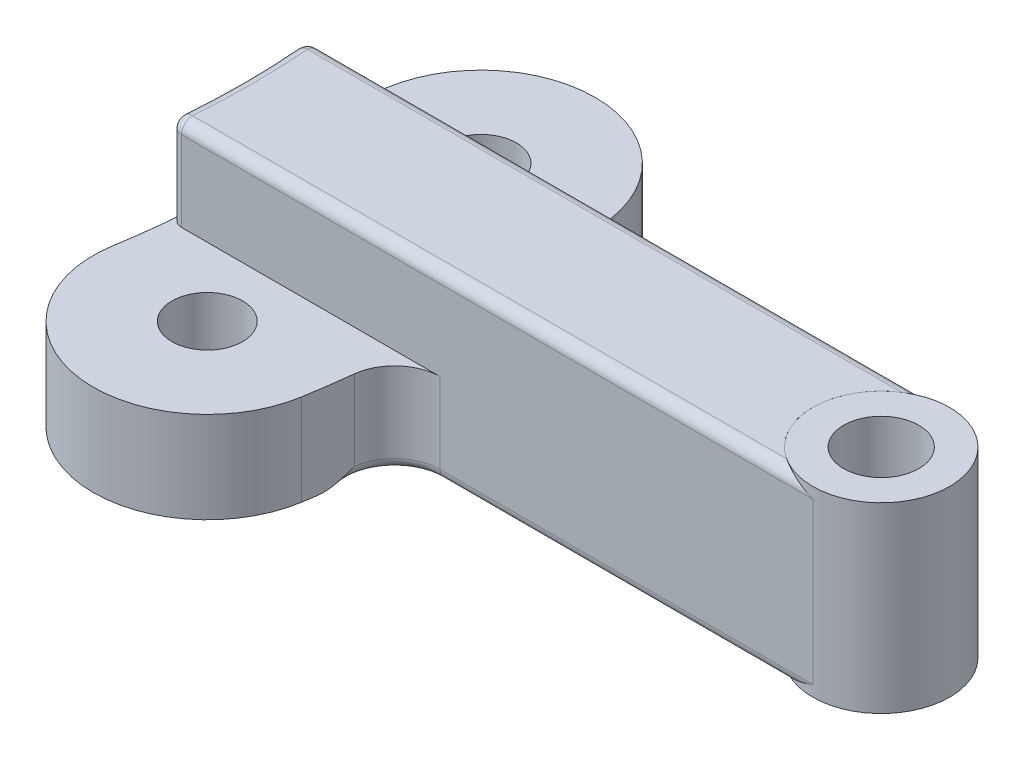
ISO-10303-21;
HEADER;
FILE_DESCRIPTION(('STEP AP214'),'2;1');
FILE_NAME('part.step','',(''),(''),'','','');
FILE_SCHEMA(('AUTOMOTIVE_DESIGN { 1 0 10303 214 1 1 1 1 }'));
ENDSEC;
DATA;
#1=APPLICATION_CONTEXT('core data for automotive mechanical design processes');
#2=APPLICATION_PROTOCOL_DEFINITION('international standard','automotive_design',2000,#1);
#3=PRODUCT_CONTEXT('',#1,'mechanical');
#4=PRODUCT('Part','Part','',(#3));
#5=PRODUCT_RELATED_PRODUCT_CATEGORY('part','',(#4));
#6=PRODUCT_DEFINITION_FORMATION('','',#4);
#7=PRODUCT_DEFINITION_CONTEXT('part definition',#1,'design');
#8=PRODUCT_DEFINITION('design','',#6,#7);
#9=PRODUCT_DEFINITION_SHAPE('','',#8);
#10=(LENGTH_UNIT() NAMED_UNIT(*) SI_UNIT(.MILLI.,.METRE.));
#11=(NAMED_UNIT(*) PLANE_ANGLE_UNIT() SI_UNIT($,.RADIAN.));
#12=(NAMED_UNIT(*) SI_UNIT($,.STERADIAN.) SOLID_ANGLE_UNIT());
#13=UNCERTAINTY_MEASURE_WITH_UNIT(LENGTH_MEASURE(1.E-05),#10,'distance_accuracy_value','');
#14=(GEOMETRIC_REPRESENTATION_CONTEXT(3) GLOBAL_UNCERTAINTY_ASSIGNED_CONTEXT((#13)) GLOBAL_UNIT_ASSIGNED_CONTEXT((#10,
#11,#12)) REPRESENTATION_CONTEXT('',''));
#15=CARTESIAN_POINT('',(0.,0.,0.));
#16=DIRECTION('',(0.,0.,1.));
#17=DIRECTION('',(1.,0.,0.));
#18=AXIS2_PLACEMENT_3D('',#15,#16,#17);
#19=CARTESIAN_POINT('',(170.901180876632,-0.00999999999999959,0.));
#20=DIRECTION('',(0.,1.,0.));
#21=DIRECTION('',(0.,0.,1.));
#22=AXIS2_PLACEMENT_3D('',#19,#20,#21);
#23=CYLINDRICAL_SURFACE('',#22,4.76250000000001);
#24=CARTESIAN_POINT('',(170.901180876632,0.,0.));
#25=DIRECTION('',(0.,1.,0.));
#26=DIRECTION('',(0.,0.,1.));
#27=AXIS2_PLACEMENT_3D('',#24,#25,#26);
#28=CIRCLE('',#27,4.7625);
#29=CARTESIAN_POINT('',(170.901180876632,0.,4.7625));
#30=VERTEX_POINT('',#29);
#31=EDGE_CURVE('E55',#30,#30,#28,.T.);
#32=ORIENTED_EDGE('',*,*,#31,.T.);
#33=EDGE_LOOP('',(#32));
#34=FACE_BOUND('',#33,.T.);
#35=CARTESIAN_POINT('',(170.901180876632,12.7,0.));
#36=DIRECTION('',(0.,1.,0.));
#37=DIRECTION('',(0.,0.,1.));
#38=AXIS2_PLACEMENT_3D('',#35,#36,#37);
#39=CIRCLE('',#38,4.7625);
#40=CARTESIAN_POINT('',(170.901180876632,12.7,4.7625));
#41=VERTEX_POINT('',#40);
#42=EDGE_CURVE('E57',#41,#41,#39,.T.);
#43=ORIENTED_EDGE('',*,*,#42,.F.);
#44=EDGE_LOOP('',(#43));
#45=FACE_BOUND('',#44,.T.);
#46=ADVANCED_FACE('F44',(#34,#45),#23,.T.);
#47=CARTESIAN_POINT('',(170.901180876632,12.7,0.));
#48=DIRECTION('',(0.,-1.,0.));
#49=DIRECTION('',(0.,0.,-1.));
#50=AXIS2_PLACEMENT_3D('',#47,#48,#49);
#51=CYLINDRICAL_SURFACE('',#50,2.61620000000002);
#52=CARTESIAN_POINT('',(170.901180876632,12.7,0.));
#53=DIRECTION('',(0.,1.,0.));
#54=DIRECTION('',(0.,0.,1.));
#55=AXIS2_PLACEMENT_3D('',#52,#53,#54);
#56=CIRCLE('',#55,2.61620000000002);
#57=CARTESIAN_POINT('',(170.901180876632,12.7,2.61620000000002));
#58=VERTEX_POINT('',#57);
#59=EDGE_CURVE('E48',#58,#58,#56,.T.);
#60=ORIENTED_EDGE('',*,*,#59,.T.);
#61=EDGE_LOOP('',(#60));
#62=FACE_BOUND('',#61,.T.);
#63=CARTESIAN_POINT('',(170.901180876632,0.,0.));
#64=DIRECTION('',(0.,1.,0.));
#65=DIRECTION('',(0.,0.,1.));
#66=AXIS2_PLACEMENT_3D('',#63,#64,#65);
#67=CIRCLE('',#66,2.61620000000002);
#68=CARTESIAN_POINT('',(170.901180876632,0.,2.61620000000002));
#69=VERTEX_POINT('',#68);
#70=EDGE_CURVE('E11',#69,#69,#67,.T.);
#71=ORIENTED_EDGE('',*,*,#70,.F.);
#72=EDGE_LOOP('',(#71));
#73=FACE_BOUND('',#72,.T.);
#74=ADVANCED_FACE('F70',(#62,#73),#51,.F.);
#75=CARTESIAN_POINT('',(170.901180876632,12.7,0.));
#76=DIRECTION('',(0.,1.,0.));
#77=DIRECTION('',(0.,0.,1.));
#78=AXIS2_PLACEMENT_3D('',#75,#76,#77);
#79=PLANE('',#78);
#80=ORIENTED_EDGE('',*,*,#59,.F.);
#81=EDGE_LOOP('',(#80));
#82=FACE_BOUND('',#81,.T.);
#83=ORIENTED_EDGE('',*,*,#42,.T.);
#84=EDGE_LOOP('',(#83));
#85=FACE_BOUND('',#84,.T.);
#86=ADVANCED_FACE('F66',(#82,#85),#79,.T.);
#87=CARTESIAN_POINT('',(170.901180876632,0.,0.));
#88=DIRECTION('',(0.,1.,0.));
#89=DIRECTION('',(0.,0.,1.));
#90=AXIS2_PLACEMENT_3D('',#87,#88,#89);
#91=PLANE('',#90);
#92=ORIENTED_EDGE('',*,*,#70,.T.);
#93=EDGE_LOOP('',(#92));
#94=FACE_BOUND('',#93,.T.);
#95=ORIENTED_EDGE('',*,*,#31,.F.);
#96=EDGE_LOOP('',(#95));
#97=FACE_BOUND('',#96,.T.);
#98=ADVANCED_FACE('F46',(#94,#97),#91,.F.);
#99=CLOSED_SHELL('',(#46,#74,#86,#98));
#100=MANIFOLD_SOLID_BREP('B2',#99);
#101=CARTESIAN_POINT('',(170.901180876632,-0.00999999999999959,0.));
#102=DIRECTION('',(0.,1.,0.));
#103=DIRECTION('',(0.,0.,1.));
#104=AXIS2_PLACEMENT_3D('',#101,#102,#103);
#105=CYLINDRICAL_SURFACE('',#104,4.76250000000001);
#106=CARTESIAN_POINT('',(170.901180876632,0.,0.));
#107=DIRECTION('',(0.,1.,0.));
#108=DIRECTION('',(0.,0.,1.));
#109=AXIS2_PLACEMENT_3D('',#106,#107,#108);
#110=CIRCLE('',#109,4.76250000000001);
#111=CARTESIAN_POINT('',(168.317113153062,0.,-4.0005));
#112=VERTEX_POINT('',#111);
#113=CARTESIAN_POINT('',(168.317113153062,0.,4.0005));
#114=VERTEX_POINT('',#113);
#115=EDGE_CURVE('E292',#112,#114,#110,.T.);
#116=ORIENTED_EDGE('',*,*,#115,.F.);
#117=CARTESIAN_POINT('',(168.317113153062,0.,-4.0005));
#118=CARTESIAN_POINT('',(168.351460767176,4.36418421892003E-06,-4.02268732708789));
#119=CARTESIAN_POINT('',(168.386083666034,0.000968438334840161,-4.04442353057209));
#120=CARTESIAN_POINT('',(168.455796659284,0.00461840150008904,-4.0869508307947));
#121=CARTESIAN_POINT('',(168.490886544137,0.00730354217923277,-4.10774233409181));
#122=CARTESIAN_POINT('',(168.596606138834,0.0176291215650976,-4.16856567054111));
#123=CARTESIAN_POINT('',(168.667852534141,0.0275416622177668,-4.20715392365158));
#124=CARTESIAN_POINT('',(168.811084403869,0.052115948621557,-4.28010847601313));
#125=CARTESIAN_POINT('',(168.883062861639,0.0667487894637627,-4.31449875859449));
#126=CARTESIAN_POINT('',(169.027953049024,0.0998518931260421,-4.37935266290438));
#127=CARTESIAN_POINT('',(169.100865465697,0.11832515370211,-4.40981318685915));
#128=CARTESIAN_POINT('',(169.290383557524,0.170090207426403,-4.48355857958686));
#129=CARTESIAN_POINT('',(169.40751640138,0.205715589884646,-4.52387700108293));
#130=CARTESIAN_POINT('',(169.642872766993,0.28236512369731,-4.59490975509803));
#131=CARTESIAN_POINT('',(169.761096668,0.323391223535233,-4.62562060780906));
#132=CARTESIAN_POINT('',(170.117297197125,0.45206820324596,-4.70383818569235));
#133=CARTESIAN_POINT('',(170.356537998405,0.545237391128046,-4.73732879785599));
#134=CARTESIAN_POINT('',(170.693335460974,0.678881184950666,-4.75896482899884));
#135=CARTESIAN_POINT('',(170.790846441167,0.717867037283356,-4.76222044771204));
#136=CARTESIAN_POINT('',(170.892637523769,0.758582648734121,-4.7624942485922));
#137=CARTESIAN_POINT('',(170.896909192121,0.760291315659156,-4.76249999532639));
#138=CARTESIAN_POINT('',(170.901180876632,0.762000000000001,-4.76250000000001));
#139=B_SPLINE_CURVE_WITH_KNOTS('',3,(#117,#118,#119,#120,#121,#122,#123,#124,#125,#126,#127,
#128,#129,#130,#131,#132,#133,#134,#135,#136,#137,#138),.UNSPECIFIED.,.F.,.F.,(4,2,2,2,2,2,2,2,
2,2,4),(0.,0.122635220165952,0.245217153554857,0.489788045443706,0.732888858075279,
0.97618014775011,1.36226841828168,1.74849636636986,2.52182618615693,2.8369223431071,
2.85072452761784),.UNSPECIFIED.);
#140=CARTESIAN_POINT('',(170.901180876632,0.762000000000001,-4.7625));
#141=VERTEX_POINT('',#140);
#142=EDGE_CURVE('E397',#112,#141,#139,.T.);
#143=ORIENTED_EDGE('',*,*,#142,.T.);
#144=DIRECTION('',(0.,-1.,0.));
#145=VECTOR('',#144,1.);
#146=CARTESIAN_POINT('',(170.901180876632,12.7,-4.7625));
#147=LINE('',#146,#145);
#148=CARTESIAN_POINT('',(170.901180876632,11.938,-4.7625));
#149=VERTEX_POINT('',#148);
#150=EDGE_CURVE('E282',#149,#141,#147,.T.);
#151=ORIENTED_EDGE('',*,*,#150,.F.);
#152=CARTESIAN_POINT('',(168.317113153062,12.7,-4.0005));
#153=CARTESIAN_POINT('',(168.351460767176,12.6999956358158,-4.02268732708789));
#154=CARTESIAN_POINT('',(168.386083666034,12.6990315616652,-4.0444235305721));
#155=CARTESIAN_POINT('',(168.455796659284,12.6953815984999,-4.08695083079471));
#156=CARTESIAN_POINT('',(168.490886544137,12.6926964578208,-4.10774233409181));
#157=CARTESIAN_POINT('',(168.596606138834,12.6823708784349,-4.16856567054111));
#158=CARTESIAN_POINT('',(168.667852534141,12.6724583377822,-4.20715392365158));
#159=CARTESIAN_POINT('',(168.811084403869,12.6478840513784,-4.28010847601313));
#160=CARTESIAN_POINT('',(168.883062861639,12.6332512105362,-4.3144987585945));
#161=CARTESIAN_POINT('',(169.027953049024,12.600148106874,-4.37935266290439));
#162=CARTESIAN_POINT('',(169.100865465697,12.5816748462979,-4.40981318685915));
#163=CARTESIAN_POINT('',(169.290383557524,12.5299097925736,-4.48355857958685));
#164=CARTESIAN_POINT('',(169.40751640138,12.4942844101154,-4.52387700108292));
#165=CARTESIAN_POINT('',(169.642872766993,12.4176348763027,-4.59490975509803));
#166=CARTESIAN_POINT('',(169.761096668,12.3766087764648,-4.62562060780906));
#167=CARTESIAN_POINT('',(170.117297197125,12.247931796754,-4.70383818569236));
#168=CARTESIAN_POINT('',(170.356537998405,12.154762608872,-4.737328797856));
#169=CARTESIAN_POINT('',(170.693335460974,12.0211188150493,-4.75896482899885));
#170=CARTESIAN_POINT('',(170.790846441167,11.9821329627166,-4.76222044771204));
#171=CARTESIAN_POINT('',(170.892637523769,11.9414173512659,-4.7624942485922));
#172=CARTESIAN_POINT('',(170.896909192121,11.9397086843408,-4.76249999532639));
#173=CARTESIAN_POINT('',(170.901180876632,11.938,-4.76250000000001));
#174=B_SPLINE_CURVE_WITH_KNOTS('',3,(#152,#153,#154,#155,#156,#157,#158,#159,#160,#161,#162,
#163,#164,#165,#166,#167,#168,#169,#170,#171,#172,#173),.UNSPECIFIED.,.F.,.F.,(4,2,2,2,2,2,2,2,
2,2,4),(0.,0.122635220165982,0.245217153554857,0.489788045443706,0.732888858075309,
0.97618014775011,1.36226841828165,1.74849636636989,2.52182618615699,2.8369223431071,
2.85072452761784),.UNSPECIFIED.);
#175=CARTESIAN_POINT('',(168.317113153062,12.7,-4.0005));
#176=VERTEX_POINT('',#175);
#177=EDGE_CURVE('E398',#149,#176,#174,.F.);
#178=ORIENTED_EDGE('',*,*,#177,.T.);
#179=CARTESIAN_POINT('',(170.901180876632,12.7,0.));
#180=DIRECTION('',(0.,1.,0.));
#181=DIRECTION('',(0.,0.,1.));
#182=AXIS2_PLACEMENT_3D('',#179,#180,#181);
#183=CIRCLE('',#182,4.76250000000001);
#184=CARTESIAN_POINT('',(168.317113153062,12.7,4.0005));
#185=VERTEX_POINT('',#184);
#186=EDGE_CURVE('E287',#176,#185,#183,.T.);
#187=ORIENTED_EDGE('',*,*,#186,.T.);
#188=CARTESIAN_POINT('',(168.317113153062,12.7,4.0005));
#189=CARTESIAN_POINT('',(168.351460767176,12.6999956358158,4.02268732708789));
#190=CARTESIAN_POINT('',(168.386083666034,12.6990315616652,4.04442353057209));
#191=CARTESIAN_POINT('',(168.455796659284,12.6953815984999,4.08695083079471));
#192=CARTESIAN_POINT('',(168.490886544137,12.6926964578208,4.10774233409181));
#193=CARTESIAN_POINT('',(168.596606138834,12.6823708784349,4.1685656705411));
#194=CARTESIAN_POINT('',(168.667852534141,12.6724583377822,4.20715392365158));
#195=CARTESIAN_POINT('',(168.811084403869,12.6478840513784,4.28010847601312));
#196=CARTESIAN_POINT('',(168.883062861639,12.6332512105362,4.31449875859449));
#197=CARTESIAN_POINT('',(169.027953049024,12.600148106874,4.37935266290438));
#198=CARTESIAN_POINT('',(169.100865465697,12.5816748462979,4.40981318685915));
#199=CARTESIAN_POINT('',(169.290383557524,12.5299097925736,4.48355857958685));
#200=CARTESIAN_POINT('',(169.40751640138,12.4942844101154,4.52387700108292));
#201=CARTESIAN_POINT('',(169.642872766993,12.4176348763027,4.59490975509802));
#202=CARTESIAN_POINT('',(169.761096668,12.3766087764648,4.62562060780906));
#203=CARTESIAN_POINT('',(170.117297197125,12.247931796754,4.70383818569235));
#204=CARTESIAN_POINT('',(170.356537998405,12.154762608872,4.73732879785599));
#205=CARTESIAN_POINT('',(170.693335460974,12.0211188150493,4.75896482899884));
#206=CARTESIAN_POINT('',(170.790846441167,11.9821329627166,4.76222044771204));
#207=CARTESIAN_POINT('',(170.892637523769,11.9414173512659,4.7624942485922));
#208=CARTESIAN_POINT('',(170.896909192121,11.9397086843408,4.76249999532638));
#209=CARTESIAN_POINT('',(170.901180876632,11.938,4.7625));
#210=B_SPLINE_CURVE_WITH_KNOTS('',3,(#188,#189,#190,#191,#192,#193,#194,#195,#196,#197,#198,
#199,#200,#201,#202,#203,#204,#205,#206,#207,#208,#209),.UNSPECIFIED.,.F.,.F.,(4,2,2,2,2,2,2,2,
2,2,4),(0.,0.122635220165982,0.245217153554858,0.489788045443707,0.73288885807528,
0.976180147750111,1.36226841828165,1.74849636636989,2.52182618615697,2.8369223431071,
2.85072452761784),.UNSPECIFIED.);
#211=CARTESIAN_POINT('',(170.901180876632,11.938,4.7625));
#212=VERTEX_POINT('',#211);
#213=EDGE_CURVE('E375',#185,#212,#210,.T.);
#214=ORIENTED_EDGE('',*,*,#213,.T.);
#215=DIRECTION('',(0.,-1.,0.));
#216=VECTOR('',#215,1.);
#217=CARTESIAN_POINT('',(170.901180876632,12.7,4.7625));
#218=LINE('',#217,#216);
#219=CARTESIAN_POINT('',(170.901180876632,0.762000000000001,4.7625));
#220=VERTEX_POINT('',#219);
#221=EDGE_CURVE('E283',#212,#220,#218,.T.);
#222=ORIENTED_EDGE('',*,*,#221,.T.);
#223=CARTESIAN_POINT('',(168.317113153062,0.,4.0005));
#224=CARTESIAN_POINT('',(168.351460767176,4.36418421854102E-06,4.02268732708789));
#225=CARTESIAN_POINT('',(168.386083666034,0.000968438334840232,4.04442353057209));
#226=CARTESIAN_POINT('',(168.455796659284,0.00461840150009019,4.08695083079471));
#227=CARTESIAN_POINT('',(168.490886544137,0.00730354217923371,4.10774233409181));
#228=CARTESIAN_POINT('',(168.596606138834,0.0176291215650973,4.1685656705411));
#229=CARTESIAN_POINT('',(168.667852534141,0.027541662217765,4.20715392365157));
#230=CARTESIAN_POINT('',(168.811084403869,0.0521159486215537,4.28010847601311));
#231=CARTESIAN_POINT('',(168.883062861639,0.0667487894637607,4.31449875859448));
#232=CARTESIAN_POINT('',(169.027953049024,0.0998518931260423,4.37935266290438));
#233=CARTESIAN_POINT('',(169.100865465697,0.118325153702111,4.40981318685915));
#234=CARTESIAN_POINT('',(169.290383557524,0.170090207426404,4.48355857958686));
#235=CARTESIAN_POINT('',(169.40751640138,0.205715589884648,4.52387700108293));
#236=CARTESIAN_POINT('',(169.642872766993,0.282365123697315,4.59490975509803));
#237=CARTESIAN_POINT('',(169.761096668,0.323391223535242,4.62562060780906));
#238=CARTESIAN_POINT('',(170.117297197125,0.452068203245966,4.70383818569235));
#239=CARTESIAN_POINT('',(170.356537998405,0.545237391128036,4.73732879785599));
#240=CARTESIAN_POINT('',(170.693335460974,0.678881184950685,4.75896482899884));
#241=CARTESIAN_POINT('',(170.790846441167,0.717867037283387,4.76222044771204));
#242=CARTESIAN_POINT('',(170.892637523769,0.758582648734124,4.7624942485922));
#243=CARTESIAN_POINT('',(170.896909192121,0.760291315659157,4.76249999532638));
#244=CARTESIAN_POINT('',(170.901180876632,0.762000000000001,4.7625));
#245=B_SPLINE_CURVE_WITH_KNOTS('',3,(#223,#224,#225,#226,#227,#228,#229,#230,#231,#232,#233,
#234,#235,#236,#237,#238,#239,#240,#241,#242,#243,#244),.UNSPECIFIED.,.F.,.F.,(4,2,2,2,2,2,2,2,
2,2,4),(0.,0.122635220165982,0.245217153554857,0.489788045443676,0.732888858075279,
0.976180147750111,1.36226841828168,1.74849636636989,2.52182618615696,2.8369223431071,
2.85072452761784),.UNSPECIFIED.);
#246=EDGE_CURVE('E392',#220,#114,#245,.F.);
#247=ORIENTED_EDGE('',*,*,#246,.T.);
#248=EDGE_LOOP('',(#116,#143,#151,#178,#187,#214,#222,#247));
#249=FACE_BOUND('',#248,.T.);
#250=ADVANCED_FACE('F111',(#249),#105,.F.);
#251=CARTESIAN_POINT('',(126.151245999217,12.7,-4.76250000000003));
#252=DIRECTION('',(0.,0.,1.));
#253=DIRECTION('',(1.,0.,0.));
#254=AXIS2_PLACEMENT_3D('',#251,#252,#253);
#255=PLANE('',#254);
#256=ORIENTED_EDGE('',*,*,#150,.T.);
#257=DIRECTION('',(-1.,0.,0.));
#258=VECTOR('',#257,1.);
#259=CARTESIAN_POINT('',(126.151245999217,0.762000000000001,-4.76250000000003));
#260=LINE('',#259,#258);
#261=CARTESIAN_POINT('',(144.972521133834,0.762000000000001,-4.76250000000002));
#262=VERTEX_POINT('',#261);
#263=EDGE_CURVE('E327',#141,#262,#260,.T.);
#264=ORIENTED_EDGE('',*,*,#263,.T.);
#265=DIRECTION('',(0.,1.,0.));
#266=VECTOR('',#265,1.);
#267=CARTESIAN_POINT('',(144.972521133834,6.35,-4.76250000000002));
#268=LINE('',#267,#266);
#269=CARTESIAN_POINT('',(144.972521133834,6.35,-4.76250000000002));
#270=VERTEX_POINT('',#269);
#271=EDGE_CURVE('E298',#262,#270,#268,.T.);
#272=ORIENTED_EDGE('',*,*,#271,.T.);
#273=DIRECTION('',(-1.,0.,0.));
#274=VECTOR('',#273,1.);
#275=CARTESIAN_POINT('',(126.151245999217,6.35,-4.76250000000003));
#276=LINE('',#275,#274);
#277=CARTESIAN_POINT('',(126.981554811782,6.35,-4.76250000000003));
#278=VERTEX_POINT('',#277);
#279=EDGE_CURVE('E273',#270,#278,#276,.T.);
#280=ORIENTED_EDGE('',*,*,#279,.T.);
#281=DIRECTION('',(0.,-1.,0.));
#282=VECTOR('',#281,1.);
#283=CARTESIAN_POINT('',(126.981554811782,12.7,-4.76250000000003));
#284=LINE('',#283,#282);
#285=CARTESIAN_POINT('',(126.981554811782,11.938,-4.76250000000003));
#286=VERTEX_POINT('',#285);
#287=EDGE_CURVE('E325',#278,#286,#284,.F.);
#288=ORIENTED_EDGE('',*,*,#287,.T.);
#289=DIRECTION('',(-1.,0.,0.));
#290=VECTOR('',#289,1.);
#291=CARTESIAN_POINT('',(170.901180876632,11.938,-4.7625));
#292=LINE('',#291,#290);
#293=EDGE_CURVE('E323',#286,#149,#292,.F.);
#294=ORIENTED_EDGE('',*,*,#293,.T.);
#295=EDGE_LOOP('',(#256,#264,#272,#280,#288,#294));
#296=FACE_BOUND('',#295,.T.);
#297=ADVANCED_FACE('F411',(#296),#255,.F.);
#298=CARTESIAN_POINT('',(126.151245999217,12.7,4.7625));
#299=DIRECTION('',(0.,0.,-1.));
#300=DIRECTION('',(-1.,0.,0.));
#301=AXIS2_PLACEMENT_3D('',#298,#299,#300);
#302=PLANE('',#301);
#303=DIRECTION('',(0.,1.,0.));
#304=VECTOR('',#303,1.);
#305=CARTESIAN_POINT('',(144.972521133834,0.,4.7625));
#306=LINE('',#305,#304);
#307=CARTESIAN_POINT('',(144.972521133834,6.35,4.7625));
#308=VERTEX_POINT('',#307);
#309=CARTESIAN_POINT('',(144.972521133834,0.762000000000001,4.7625));
#310=VERTEX_POINT('',#309);
#311=EDGE_CURVE('E302',#308,#310,#306,.F.);
#312=ORIENTED_EDGE('',*,*,#311,.T.);
#313=DIRECTION('',(1.,0.,0.));
#314=VECTOR('',#313,1.);
#315=CARTESIAN_POINT('',(126.151245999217,0.762000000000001,4.7625));
#316=LINE('',#315,#314);
#317=EDGE_CURVE('E333',#310,#220,#316,.T.);
#318=ORIENTED_EDGE('',*,*,#317,.T.);
#319=ORIENTED_EDGE('',*,*,#221,.F.);
#320=DIRECTION('',(1.,0.,0.));
#321=VECTOR('',#320,1.);
#322=CARTESIAN_POINT('',(126.151245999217,11.938,4.7625));
#323=LINE('',#322,#321);
#324=CARTESIAN_POINT('',(126.981554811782,11.938,4.7625));
#325=VERTEX_POINT('',#324);
#326=EDGE_CURVE('E329',#212,#325,#323,.F.);
#327=ORIENTED_EDGE('',*,*,#326,.T.);
#328=DIRECTION('',(0.,-1.,0.));
#329=VECTOR('',#328,1.);
#330=CARTESIAN_POINT('',(126.981554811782,12.7,4.7625));
#331=LINE('',#330,#329);
#332=CARTESIAN_POINT('',(126.981554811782,6.35,4.7625));
#333=VERTEX_POINT('',#332);
#334=EDGE_CURVE('E331',#325,#333,#331,.T.);
#335=ORIENTED_EDGE('',*,*,#334,.T.);
#336=DIRECTION('',(1.,0.,0.));
#337=VECTOR('',#336,1.);
#338=CARTESIAN_POINT('',(126.151245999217,6.35,4.7625));
#339=LINE('',#338,#337);
#340=EDGE_CURVE('E290',#333,#308,#339,.T.);
#341=ORIENTED_EDGE('',*,*,#340,.T.);
#342=EDGE_LOOP('',(#312,#318,#319,#327,#335,#341));
#343=FACE_BOUND('',#342,.T.);
#344=ADVANCED_FACE('F528',(#343),#302,.F.);
#345=CARTESIAN_POINT('',(170.901180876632,12.7,0.));
#346=DIRECTION('',(0.,1.,0.));
#347=DIRECTION('',(0.,0.,1.));
#348=AXIS2_PLACEMENT_3D('',#345,#346,#347);
#349=PLANE('',#348);
#350=ORIENTED_EDGE('',*,*,#186,.F.);
#351=DIRECTION('',(-1.,0.,0.));
#352=VECTOR('',#351,1.);
#353=CARTESIAN_POINT('',(126.151245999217,12.7,-4.00050000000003));
#354=LINE('',#353,#352);
#355=CARTESIAN_POINT('',(126.981554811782,12.7,-4.00050000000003));
#356=VERTEX_POINT('',#355);
#357=EDGE_CURVE('E315',#176,#356,#354,.T.);
#358=ORIENTED_EDGE('',*,*,#357,.T.);
#359=CARTESIAN_POINT('',(75.5749808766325,12.7,0.));
#360=DIRECTION('',(0.,1.,0.));
#361=DIRECTION('',(0.,0.,1.));
#362=AXIS2_PLACEMENT_3D('',#359,#360,#361);
#363=CIRCLE('',#362,51.5619999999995);
#364=CARTESIAN_POINT('',(126.981554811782,12.7,4.0005));
#365=VERTEX_POINT('',#364);
#366=EDGE_CURVE('E312',#356,#365,#363,.F.);
#367=ORIENTED_EDGE('',*,*,#366,.T.);
#368=DIRECTION('',(1.,0.,0.));
#369=VECTOR('',#368,1.);
#370=CARTESIAN_POINT('',(170.901180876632,12.7,4.0005));
#371=LINE('',#370,#369);
#372=EDGE_CURVE('E310',#365,#185,#371,.T.);
#373=ORIENTED_EDGE('',*,*,#372,.T.);
#374=EDGE_LOOP('',(#350,#358,#367,#373));
#375=FACE_BOUND('',#374,.T.);
#376=ADVANCED_FACE('F655',(#375),#349,.T.);
#377=CARTESIAN_POINT('',(170.901180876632,0.,0.));
#378=DIRECTION('',(0.,1.,0.));
#379=DIRECTION('',(0.,0.,1.));
#380=AXIS2_PLACEMENT_3D('',#377,#378,#379);
#381=PLANE('',#380);
#382=CARTESIAN_POINT('',(133.535038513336,0.,9.52500000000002));
#383=DIRECTION('',(0.,1.,0.));
#384=DIRECTION('',(0.,0.,1.));
#385=AXIS2_PLACEMENT_3D('',#382,#383,#384);
#386=CIRCLE('',#385,2.45745);
#387=CARTESIAN_POINT('',(133.535038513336,0.,11.98245));
#388=VERTEX_POINT('',#387);
#389=EDGE_CURVE('E731',#388,#388,#386,.T.);
#390=ORIENTED_EDGE('',*,*,#389,.T.);
#391=EDGE_LOOP('',(#390));
#392=FACE_BOUND('',#391,.T.);
#393=CARTESIAN_POINT('',(133.535038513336,0.,-9.52499999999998));
#394=DIRECTION('',(0.,1.,0.));
#395=DIRECTION('',(0.,0.,1.));
#396=AXIS2_PLACEMENT_3D('',#393,#394,#395);
#397=CIRCLE('',#396,2.45745);
#398=CARTESIAN_POINT('',(133.535038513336,0.,-7.06754999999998));
#399=VERTEX_POINT('',#398);
#400=EDGE_CURVE('E501',#399,#399,#397,.T.);
#401=ORIENTED_EDGE('',*,*,#400,.T.);
#402=EDGE_LOOP('',(#401));
#403=FACE_BOUND('',#402,.T.);
#404=CARTESIAN_POINT('',(75.5749808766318,0.,0.));
#405=DIRECTION('',(0.,1.,0.));
#406=DIRECTION('',(0.,0.,1.));
#407=AXIS2_PLACEMENT_3D('',#404,#405,#406);
#408=CIRCLE('',#407,66.6750000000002);
#409=CARTESIAN_POINT('',(141.521126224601,0.,-9.83166001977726));
#410=VERTEX_POINT('',#409);
#411=CARTESIAN_POINT('',(141.367478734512,0.,-10.8121621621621));
#412=VERTEX_POINT('',#411);
#413=EDGE_CURVE('E494',#410,#412,#408,.T.);
#414=ORIENTED_EDGE('',*,*,#413,.F.);
#415=CARTESIAN_POINT('',(144.972521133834,0.,-7.93750000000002));
#416=DIRECTION('',(0.,1.,0.));
#417=DIRECTION('',(0.,0.,1.));
#418=AXIS2_PLACEMENT_3D('',#415,#416,#417);
#419=CIRCLE('',#418,3.937);
#420=CARTESIAN_POINT('',(144.972521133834,0.,-4.00050000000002));
#421=VERTEX_POINT('',#420);
#422=EDGE_CURVE('E342',#410,#421,#419,.T.);
#423=ORIENTED_EDGE('',*,*,#422,.T.);
#424=DIRECTION('',(-1.,0.,0.));
#425=VECTOR('',#424,1.);
#426=CARTESIAN_POINT('',(170.901180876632,0.,-4.0005));
#427=LINE('',#426,#425);
#428=EDGE_CURVE('E340',#421,#112,#427,.F.);
#429=ORIENTED_EDGE('',*,*,#428,.T.);
#430=ORIENTED_EDGE('',*,*,#115,.T.);
#431=DIRECTION('',(1.,0.,0.));
#432=VECTOR('',#431,1.);
#433=CARTESIAN_POINT('',(170.901180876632,0.,4.0005));
#434=LINE('',#433,#432);
#435=CARTESIAN_POINT('',(144.972521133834,0.,4.0005));
#436=VERTEX_POINT('',#435);
#437=EDGE_CURVE('E335',#114,#436,#434,.F.);
#438=ORIENTED_EDGE('',*,*,#437,.T.);
#439=CARTESIAN_POINT('',(144.972521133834,0.,7.9375));
#440=DIRECTION('',(0.,1.,0.));
#441=DIRECTION('',(0.,0.,1.));
#442=AXIS2_PLACEMENT_3D('',#439,#440,#441);
#443=CIRCLE('',#442,3.937);
#444=CARTESIAN_POINT('',(141.521126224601,0.,9.83166001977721));
#445=VERTEX_POINT('',#444);
#446=EDGE_CURVE('E337',#436,#445,#443,.T.);
#447=ORIENTED_EDGE('',*,*,#446,.T.);
#448=CARTESIAN_POINT('',(141.367478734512,0.,10.8121621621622));
#449=VERTEX_POINT('',#448);
#450=EDGE_CURVE('E498',#449,#445,#408,.T.);
#451=ORIENTED_EDGE('',*,*,#450,.F.);
#452=CARTESIAN_POINT('',(133.535038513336,0.,9.52500000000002));
#453=DIRECTION('',(0.,1.,0.));
#454=DIRECTION('',(0.,0.,-1.));
#455=AXIS2_PLACEMENT_3D('',#452,#453,#454);
#456=CIRCLE('',#455,7.9375);
#457=CARTESIAN_POINT('',(125.702598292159,0.,8.23783783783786));
#458=VERTEX_POINT('',#457);
#459=EDGE_CURVE('E499',#458,#449,#456,.T.);
#460=ORIENTED_EDGE('',*,*,#459,.F.);
#461=CARTESIAN_POINT('',(75.5749808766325,0.,0.));
#462=DIRECTION('',(0.,-1.,0.));
#463=DIRECTION('',(0.,0.,1.));
#464=AXIS2_PLACEMENT_3D('',#461,#462,#463);
#465=CIRCLE('',#464,50.7999999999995);
#466=CARTESIAN_POINT('',(125.702598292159,0.,-8.23783783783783));
#467=VERTEX_POINT('',#466);
#468=EDGE_CURVE('E271',#467,#458,#465,.T.);
#469=ORIENTED_EDGE('',*,*,#468,.F.);
#470=CARTESIAN_POINT('',(133.535038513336,0.,-9.52499999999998));
#471=DIRECTION('',(0.,1.,0.));
#472=DIRECTION('',(0.,0.,1.));
#473=AXIS2_PLACEMENT_3D('',#470,#471,#472);
#474=CIRCLE('',#473,7.9375);
#475=EDGE_CURVE('E257',#412,#467,#474,.T.);
#476=ORIENTED_EDGE('',*,*,#475,.F.);
#477=EDGE_LOOP('',(#414,#423,#429,#430,#438,#447,#451,#460,#469,#476));
#478=FACE_BOUND('',#477,.T.);
#479=ADVANCED_FACE('F492',(#392,#403,#478),#381,.F.);
#480=CARTESIAN_POINT('',(75.5749808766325,12.7,0.));
#481=DIRECTION('',(0.,-1.,0.));
#482=DIRECTION('',(0.,0.,-1.));
#483=AXIS2_PLACEMENT_3D('',#480,#481,#482);
#484=CYLINDRICAL_SURFACE('',#483,50.7999999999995);
#485=DIRECTION('',(0.,-1.,0.));
#486=VECTOR('',#485,1.);
#487=CARTESIAN_POINT('',(126.221851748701,12.7,-3.94137931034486));
#488=LINE('',#487,#486);
#489=CARTESIAN_POINT('',(126.221851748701,11.938,-3.94137931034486));
#490=VERTEX_POINT('',#489);
#491=CARTESIAN_POINT('',(126.221851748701,6.35,-3.94137931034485));
#492=VERTEX_POINT('',#491);
#493=EDGE_CURVE('E321',#490,#492,#488,.T.);
#494=ORIENTED_EDGE('',*,*,#493,.T.);
#495=CARTESIAN_POINT('',(75.5749808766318,6.35,0.));
#496=DIRECTION('',(0.,-1.,0.));
#497=DIRECTION('',(0.,0.,1.));
#498=AXIS2_PLACEMENT_3D('',#495,#496,#497);
#499=CIRCLE('',#498,50.8000000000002);
#500=CARTESIAN_POINT('',(125.702598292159,6.35,-8.23783783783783));
#501=VERTEX_POINT('',#500);
#502=EDGE_CURVE('E256',#501,#492,#499,.T.);
#503=ORIENTED_EDGE('',*,*,#502,.F.);
#504=DIRECTION('',(0.,-1.,0.));
#505=VECTOR('',#504,1.);
#506=CARTESIAN_POINT('',(125.702598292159,6.35,-8.23783783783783));
#507=LINE('',#506,#505);
#508=EDGE_CURVE('E506',#501,#467,#507,.T.);
#509=ORIENTED_EDGE('',*,*,#508,.T.);
#510=ORIENTED_EDGE('',*,*,#468,.T.);
#511=DIRECTION('',(0.,-1.,0.));
#512=VECTOR('',#511,1.);
#513=CARTESIAN_POINT('',(125.702598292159,6.35,8.23783783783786));
#514=LINE('',#513,#512);
#515=CARTESIAN_POINT('',(125.702598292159,6.35,8.23783783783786));
#516=VERTEX_POINT('',#515);
#517=EDGE_CURVE('E262',#516,#458,#514,.T.);
#518=ORIENTED_EDGE('',*,*,#517,.F.);
#519=CARTESIAN_POINT('',(126.221851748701,6.35,3.94137931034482));
#520=VERTEX_POINT('',#519);
#521=EDGE_CURVE('E245',#520,#516,#499,.T.);
#522=ORIENTED_EDGE('',*,*,#521,.F.);
#523=DIRECTION('',(0.,-1.,0.));
#524=VECTOR('',#523,1.);
#525=CARTESIAN_POINT('',(126.221851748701,12.7,3.94137931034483));
#526=LINE('',#525,#524);
#527=CARTESIAN_POINT('',(126.221851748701,11.938,3.94137931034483));
#528=VERTEX_POINT('',#527);
#529=EDGE_CURVE('E317',#520,#528,#526,.F.);
#530=ORIENTED_EDGE('',*,*,#529,.T.);
#531=CARTESIAN_POINT('',(75.5749808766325,11.938,0.));
#532=DIRECTION('',(0.,1.,0.));
#533=DIRECTION('',(0.,0.,1.));
#534=AXIS2_PLACEMENT_3D('',#531,#532,#533);
#535=CIRCLE('',#534,50.7999999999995);
#536=EDGE_CURVE('E319',#528,#490,#535,.T.);
#537=ORIENTED_EDGE('',*,*,#536,.T.);
#538=EDGE_LOOP('',(#494,#503,#509,#510,#518,#522,#530,#537));
#539=FACE_BOUND('',#538,.T.);
#540=ADVANCED_FACE('F269',(#539),#484,.F.);
#541=CARTESIAN_POINT('',(133.535038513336,6.35,9.52500000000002));
#542=DIRECTION('',(0.,-1.,0.));
#543=DIRECTION('',(0.,0.,-1.));
#544=AXIS2_PLACEMENT_3D('',#541,#542,#543);
#545=CYLINDRICAL_SURFACE('',#544,7.9375);
#546=ORIENTED_EDGE('',*,*,#459,.T.);
#547=DIRECTION('',(0.,-1.,0.));
#548=VECTOR('',#547,1.);
#549=CARTESIAN_POINT('',(141.367478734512,6.35,10.8121621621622));
#550=LINE('',#549,#548);
#551=CARTESIAN_POINT('',(141.367478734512,6.35,10.8121621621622));
#552=VERTEX_POINT('',#551);
#553=EDGE_CURVE('E264',#552,#449,#550,.T.);
#554=ORIENTED_EDGE('',*,*,#553,.F.);
#555=CARTESIAN_POINT('',(133.535038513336,6.35,9.52500000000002));
#556=DIRECTION('',(0.,1.,0.));
#557=DIRECTION('',(0.,0.,-1.));
#558=AXIS2_PLACEMENT_3D('',#555,#556,#557);
#559=CIRCLE('',#558,7.9375);
#560=EDGE_CURVE('E250',#516,#552,#559,.T.);
#561=ORIENTED_EDGE('',*,*,#560,.F.);
#562=ORIENTED_EDGE('',*,*,#517,.T.);
#563=EDGE_LOOP('',(#546,#554,#561,#562));
#564=FACE_BOUND('',#563,.T.);
#565=ADVANCED_FACE('F261',(#564),#545,.T.);
#566=CARTESIAN_POINT('',(104.555009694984,6.35,-4.76249999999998));
#567=DIRECTION('',(0.,1.,0.));
#568=DIRECTION('',(0.,0.,1.));
#569=AXIS2_PLACEMENT_3D('',#566,#567,#568);
#570=PLANE('',#569);
#571=CARTESIAN_POINT('',(133.535038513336,6.35,9.52500000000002));
#572=DIRECTION('',(0.,1.,0.));
#573=DIRECTION('',(0.,0.,1.));
#574=AXIS2_PLACEMENT_3D('',#571,#572,#573);
#575=CIRCLE('',#574,2.45745);
#576=CARTESIAN_POINT('',(133.535038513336,6.35,11.98245));
#577=VERTEX_POINT('',#576);
#578=EDGE_CURVE('E476',#577,#577,#575,.T.);
#579=ORIENTED_EDGE('',*,*,#578,.F.);
#580=EDGE_LOOP('',(#579));
#581=FACE_BOUND('',#580,.T.);
#582=ORIENTED_EDGE('',*,*,#340,.F.);
#583=CARTESIAN_POINT('',(126.981554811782,6.35,4.0005));
#584=DIRECTION('',(0.,1.,0.));
#585=DIRECTION('',(0.,0.,1.));
#586=AXIS2_PLACEMENT_3D('',#583,#584,#585);
#587=CIRCLE('',#586,0.762);
#588=EDGE_CURVE('E42',#333,#520,#587,.F.);
#589=ORIENTED_EDGE('',*,*,#588,.T.);
#590=ORIENTED_EDGE('',*,*,#521,.T.);
#591=ORIENTED_EDGE('',*,*,#560,.T.);
#592=CARTESIAN_POINT('',(75.5749808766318,6.35,0.));
#593=DIRECTION('',(0.,1.,0.));
#594=DIRECTION('',(0.,0.,1.));
#595=AXIS2_PLACEMENT_3D('',#592,#593,#594);
#596=CIRCLE('',#595,66.6750000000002);
#597=CARTESIAN_POINT('',(141.81808748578,6.35,7.57670454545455));
#598=VERTEX_POINT('',#597);
#599=EDGE_CURVE('E512',#552,#598,#596,.T.);
#600=ORIENTED_EDGE('',*,*,#599,.T.);
#601=CARTESIAN_POINT('',(144.972521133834,6.35,7.9375));
#602=DIRECTION('',(0.,1.,0.));
#603=DIRECTION('',(0.,0.,1.));
#604=AXIS2_PLACEMENT_3D('',#601,#602,#603);
#605=CIRCLE('',#604,3.175);
#606=EDGE_CURVE('E307',#598,#308,#605,.F.);
#607=ORIENTED_EDGE('',*,*,#606,.T.);
#608=EDGE_LOOP('',(#582,#589,#590,#591,#600,#607));
#609=FACE_BOUND('',#608,.T.);
#610=ADVANCED_FACE('F248',(#581,#609),#570,.T.);
#611=CARTESIAN_POINT('',(75.5749808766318,6.35,0.));
#612=DIRECTION('',(0.,-1.,0.));
#613=DIRECTION('',(0.,0.,-1.));
#614=AXIS2_PLACEMENT_3D('',#611,#612,#613);
#615=CYLINDRICAL_SURFACE('',#614,66.6750000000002);
#616=ORIENTED_EDGE('',*,*,#450,.T.);
#617=CARTESIAN_POINT('',(141.521126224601,0.,9.83166001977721));
#618=CARTESIAN_POINT('',(141.527017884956,3.54991154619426E-06,9.79214210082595));
#619=CARTESIAN_POINT('',(141.532871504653,0.00115018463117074,9.75263461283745));
#620=CARTESIAN_POINT('',(141.544488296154,0.00551899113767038,9.67374292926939));
#621=CARTESIAN_POINT('',(141.550251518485,0.00873995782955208,9.63435867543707));
#622=CARTESIAN_POINT('',(141.567358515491,0.021174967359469,9.51672121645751));
#623=CARTESIAN_POINT('',(141.578556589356,0.0331638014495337,9.43873526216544));
#624=CARTESIAN_POINT('',(141.600369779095,0.0629571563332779,9.28491297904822));
#625=CARTESIAN_POINT('',(141.610990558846,0.0806845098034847,9.20906189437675));
#626=CARTESIAN_POINT('',(141.631809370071,0.120907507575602,9.0585214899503));
#627=CARTESIAN_POINT('',(141.642007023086,0.143407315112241,8.98383324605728));
#628=CARTESIAN_POINT('',(141.667412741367,0.205487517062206,8.79541920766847));
#629=CARTESIAN_POINT('',(141.682332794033,0.247706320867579,8.68253095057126));
#630=CARTESIAN_POINT('',(141.711277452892,0.338403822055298,8.45922896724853));
#631=CARTESIAN_POINT('',(141.725301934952,0.386883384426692,8.34881558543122));
#632=CARTESIAN_POINT('',(141.766334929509,0.538619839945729,8.01932829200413));
#633=CARTESIAN_POINT('',(141.792182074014,0.64783535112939,7.80290789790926));
#634=CARTESIAN_POINT('',(141.817341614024,0.758709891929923,7.58322354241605));
#635=CARTESIAN_POINT('',(141.817714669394,0.760354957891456,7.57996405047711));
#636=CARTESIAN_POINT('',(141.81808748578,0.762,7.57670454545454));
#637=B_SPLINE_CURVE_WITH_KNOTS('',3,(#617,#618,#619,#620,#621,#622,#623,#624,#625,#626,#627,
#628,#629,#630,#631,#632,#633,#634,#635,#636),.UNSPECIFIED.,.F.,.F.,(4,2,2,2,2,2,2,2,2,4),(0.,
0.11982263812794,0.239575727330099,0.47833278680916,0.714004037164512,0.949881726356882,
1.31391481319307,1.67799824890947,2.4090658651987,2.42007619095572),.UNSPECIFIED.);
#638=CARTESIAN_POINT('',(141.81808748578,0.762,7.57670454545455));
#639=VERTEX_POINT('',#638);
#640=EDGE_CURVE('E137',#445,#639,#637,.T.);
#641=ORIENTED_EDGE('',*,*,#640,.T.);
#642=DIRECTION('',(0.,-1.,0.));
#643=VECTOR('',#642,1.);
#644=CARTESIAN_POINT('',(141.81808748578,6.35,7.57670454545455));
#645=LINE('',#644,#643);
#646=EDGE_CURVE('E300',#639,#598,#645,.F.);
#647=ORIENTED_EDGE('',*,*,#646,.T.);
#648=ORIENTED_EDGE('',*,*,#599,.F.);
#649=ORIENTED_EDGE('',*,*,#553,.T.);
#650=EDGE_LOOP('',(#616,#641,#647,#648,#649));
#651=FACE_BOUND('',#650,.T.);
#652=ADVANCED_FACE('F363',(#651),#615,.T.);
#653=DIRECTION('',(0.,-1.,0.));
#654=VECTOR('',#653,1.);
#655=CARTESIAN_POINT('',(141.81808748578,6.35,-7.57670454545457));
#656=LINE('',#655,#654);
#657=CARTESIAN_POINT('',(141.81808748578,6.35,-7.57670454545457));
#658=VERTEX_POINT('',#657);
#659=CARTESIAN_POINT('',(141.81808748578,0.762,-7.57670454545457));
#660=VERTEX_POINT('',#659);
#661=EDGE_CURVE('E286',#658,#660,#656,.T.);
#662=ORIENTED_EDGE('',*,*,#661,.T.);
#663=CARTESIAN_POINT('',(141.521126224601,0.,-9.83166001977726));
#664=CARTESIAN_POINT('',(141.527017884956,3.54991154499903E-06,-9.79214210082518));
#665=CARTESIAN_POINT('',(141.532871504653,0.00115018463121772,-9.75263461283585));
#666=CARTESIAN_POINT('',(141.544488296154,0.00551899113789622,-9.67374292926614));
#667=CARTESIAN_POINT('',(141.550251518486,0.00873995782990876,-9.63435867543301));
#668=CARTESIAN_POINT('',(141.567358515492,0.0211749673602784,-9.51672121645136));
#669=CARTESIAN_POINT('',(141.578556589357,0.0331638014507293,-9.43873526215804));
#670=CARTESIAN_POINT('',(141.600369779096,0.0629571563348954,-9.28491297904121));
#671=CARTESIAN_POINT('',(141.610990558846,0.0806845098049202,-9.20906189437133));
#672=CARTESIAN_POINT('',(141.631809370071,0.120907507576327,-9.05852148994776));
#673=CARTESIAN_POINT('',(141.642007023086,0.143407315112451,-8.983833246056));
#674=CARTESIAN_POINT('',(141.667412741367,0.205487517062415,-8.79541920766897));
#675=CARTESIAN_POINT('',(141.682332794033,0.247706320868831,-8.6825309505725));
#676=CARTESIAN_POINT('',(141.711277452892,0.338403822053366,-8.45922896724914));
#677=CARTESIAN_POINT('',(141.725301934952,0.38688338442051,-8.34881558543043));
#678=CARTESIAN_POINT('',(141.766334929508,0.538619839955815,-8.01932829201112));
#679=CARTESIAN_POINT('',(141.79218207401,0.647835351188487,-7.80290789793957));
#680=CARTESIAN_POINT('',(141.817341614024,0.758709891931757,-7.58322354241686));
#681=CARTESIAN_POINT('',(141.817714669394,0.760354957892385,-7.57996405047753));
#682=CARTESIAN_POINT('',(141.81808748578,0.762,-7.57670454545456));
#683=B_SPLINE_CURVE_WITH_KNOTS('',3,(#663,#664,#665,#666,#667,#668,#669,#670,#671,#672,#673,
#674,#675,#676,#677,#678,#679,#680,#681,#682),.UNSPECIFIED.,.F.,.F.,(4,2,2,2,2,2,2,2,2,4),(0.,
0.119822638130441,0.239575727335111,0.478332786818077,0.71400403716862,0.949881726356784,
1.31391481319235,1.67799824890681,2.40906586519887,2.42007619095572),.UNSPECIFIED.);
#684=EDGE_CURVE('E370',#660,#410,#683,.F.);
#685=ORIENTED_EDGE('',*,*,#684,.T.);
#686=ORIENTED_EDGE('',*,*,#413,.T.);
#687=DIRECTION('',(0.,-1.,0.));
#688=VECTOR('',#687,1.);
#689=CARTESIAN_POINT('',(141.367478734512,6.35,-10.8121621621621));
#690=LINE('',#689,#688);
#691=CARTESIAN_POINT('',(141.367478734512,6.35,-10.8121621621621));
#692=VERTEX_POINT('',#691);
#693=EDGE_CURVE('E277',#692,#412,#690,.T.);
#694=ORIENTED_EDGE('',*,*,#693,.F.);
#695=EDGE_CURVE('E266',#658,#692,#596,.T.);
#696=ORIENTED_EDGE('',*,*,#695,.F.);
#697=EDGE_LOOP('',(#662,#685,#686,#694,#696));
#698=FACE_BOUND('',#697,.T.);
#699=ADVANCED_FACE('F357',(#698),#615,.T.);
#700=CARTESIAN_POINT('',(133.535038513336,6.35,-9.52499999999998));
#701=DIRECTION('',(0.,1.,0.));
#702=DIRECTION('',(0.,0.,1.));
#703=AXIS2_PLACEMENT_3D('',#700,#701,#702);
#704=CIRCLE('',#703,2.45745);
#705=CARTESIAN_POINT('',(133.535038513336,6.35,-7.06754999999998));
#706=VERTEX_POINT('',#705);
#707=EDGE_CURVE('E729',#706,#706,#704,.T.);
#708=ORIENTED_EDGE('',*,*,#707,.F.);
#709=EDGE_LOOP('',(#708));
#710=FACE_BOUND('',#709,.T.);
#711=ORIENTED_EDGE('',*,*,#279,.F.);
#712=CARTESIAN_POINT('',(144.972521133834,6.35,-7.93750000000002));
#713=DIRECTION('',(0.,1.,0.));
#714=DIRECTION('',(0.,0.,1.));
#715=AXIS2_PLACEMENT_3D('',#712,#713,#714);
#716=CIRCLE('',#715,3.175);
#717=EDGE_CURVE('E305',#270,#658,#716,.F.);
#718=ORIENTED_EDGE('',*,*,#717,.T.);
#719=ORIENTED_EDGE('',*,*,#695,.T.);
#720=CARTESIAN_POINT('',(133.535038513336,6.35,-9.52499999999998));
#721=DIRECTION('',(0.,1.,0.));
#722=DIRECTION('',(0.,0.,1.));
#723=AXIS2_PLACEMENT_3D('',#720,#721,#722);
#724=CIRCLE('',#723,7.9375);
#725=EDGE_CURVE('E507',#692,#501,#724,.T.);
#726=ORIENTED_EDGE('',*,*,#725,.T.);
#727=ORIENTED_EDGE('',*,*,#502,.T.);
#728=CARTESIAN_POINT('',(126.981554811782,6.35,-4.00050000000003));
#729=DIRECTION('',(0.,1.,0.));
#730=DIRECTION('',(0.,0.,1.));
#731=AXIS2_PLACEMENT_3D('',#728,#729,#730);
#732=CIRCLE('',#731,0.762);
#733=EDGE_CURVE('E121',#492,#278,#732,.F.);
#734=ORIENTED_EDGE('',*,*,#733,.T.);
#735=EDGE_LOOP('',(#711,#718,#719,#726,#727,#734));
#736=FACE_BOUND('',#735,.T.);
#737=ADVANCED_FACE('F362',(#710,#736),#570,.T.);
#738=CARTESIAN_POINT('',(133.535038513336,6.35,-9.52499999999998));
#739=DIRECTION('',(0.,-1.,0.));
#740=DIRECTION('',(0.,0.,-1.));
#741=AXIS2_PLACEMENT_3D('',#738,#739,#740);
#742=CYLINDRICAL_SURFACE('',#741,7.9375);
#743=ORIENTED_EDGE('',*,*,#475,.T.);
#744=ORIENTED_EDGE('',*,*,#508,.F.);
#745=ORIENTED_EDGE('',*,*,#725,.F.);
#746=ORIENTED_EDGE('',*,*,#693,.T.);
#747=EDGE_LOOP('',(#743,#744,#745,#746));
#748=FACE_BOUND('',#747,.T.);
#749=ADVANCED_FACE('F365',(#748),#742,.T.);
#750=CARTESIAN_POINT('',(133.535038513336,6.35,-9.52499999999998));
#751=DIRECTION('',(0.,1.,0.));
#752=DIRECTION('',(0.,0.,1.));
#753=AXIS2_PLACEMENT_3D('',#750,#751,#752);
#754=CYLINDRICAL_SURFACE('',#753,2.45745);
#755=ORIENTED_EDGE('',*,*,#400,.F.);
#756=EDGE_LOOP('',(#755));
#757=FACE_BOUND('',#756,.T.);
#758=ORIENTED_EDGE('',*,*,#707,.T.);
#759=EDGE_LOOP('',(#758));
#760=FACE_BOUND('',#759,.T.);
#761=ADVANCED_FACE('F626',(#757,#760),#754,.F.);
#762=CARTESIAN_POINT('',(133.535038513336,6.35,9.52500000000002));
#763=DIRECTION('',(0.,1.,0.));
#764=DIRECTION('',(0.,0.,1.));
#765=AXIS2_PLACEMENT_3D('',#762,#763,#764);
#766=CYLINDRICAL_SURFACE('',#765,2.45745);
#767=ORIENTED_EDGE('',*,*,#389,.F.);
#768=EDGE_LOOP('',(#767));
#769=FACE_BOUND('',#768,.T.);
#770=ORIENTED_EDGE('',*,*,#578,.T.);
#771=EDGE_LOOP('',(#770));
#772=FACE_BOUND('',#771,.T.);
#773=ADVANCED_FACE('F413',(#769,#772),#766,.F.);
#774=CARTESIAN_POINT('',(144.972521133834,6.35,-7.93750000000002));
#775=DIRECTION('',(0.,-1.,0.));
#776=DIRECTION('',(0.,0.,-1.));
#777=AXIS2_PLACEMENT_3D('',#774,#775,#776);
#778=CYLINDRICAL_SURFACE('',#777,3.175);
#779=ORIENTED_EDGE('',*,*,#271,.F.);
#780=CARTESIAN_POINT('',(144.972521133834,0.762,-7.93750000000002));
#781=DIRECTION('',(0.,1.,0.));
#782=DIRECTION('',(0.,0.,1.));
#783=AXIS2_PLACEMENT_3D('',#780,#781,#782);
#784=CIRCLE('',#783,3.175);
#785=EDGE_CURVE('E129',#262,#660,#784,.F.);
#786=ORIENTED_EDGE('',*,*,#785,.T.);
#787=ORIENTED_EDGE('',*,*,#661,.F.);
#788=ORIENTED_EDGE('',*,*,#717,.F.);
#789=EDGE_LOOP('',(#779,#786,#787,#788));
#790=FACE_BOUND('',#789,.T.);
#791=ADVANCED_FACE('F415',(#790),#778,.F.);
#792=CARTESIAN_POINT('',(144.972521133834,6.35,7.9375));
#793=DIRECTION('',(0.,-1.,0.));
#794=DIRECTION('',(0.,0.,-1.));
#795=AXIS2_PLACEMENT_3D('',#792,#793,#794);
#796=CYLINDRICAL_SURFACE('',#795,3.175);
#797=ORIENTED_EDGE('',*,*,#646,.F.);
#798=CARTESIAN_POINT('',(144.972521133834,0.762,7.9375));
#799=DIRECTION('',(0.,1.,0.));
#800=DIRECTION('',(0.,0.,1.));
#801=AXIS2_PLACEMENT_3D('',#798,#799,#800);
#802=CIRCLE('',#801,3.175);
#803=EDGE_CURVE('E351',#639,#310,#802,.F.);
#804=ORIENTED_EDGE('',*,*,#803,.T.);
#805=ORIENTED_EDGE('',*,*,#311,.F.);
#806=ORIENTED_EDGE('',*,*,#606,.F.);
#807=EDGE_LOOP('',(#797,#804,#805,#806));
#808=FACE_BOUND('',#807,.T.);
#809=ADVANCED_FACE('F421',(#808),#796,.F.);
#810=CARTESIAN_POINT('',(126.981554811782,12.7,-4.00050000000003));
#811=DIRECTION('',(0.,-1.,0.));
#812=DIRECTION('',(0.,0.,-1.));
#813=AXIS2_PLACEMENT_3D('',#810,#811,#812);
#814=CYLINDRICAL_SURFACE('',#813,0.762);
#815=ORIENTED_EDGE('',*,*,#733,.F.);
#816=ORIENTED_EDGE('',*,*,#493,.F.);
#817=CARTESIAN_POINT('',(126.981554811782,11.938,-4.00050000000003));
#818=DIRECTION('',(0.,1.,0.));
#819=DIRECTION('',(0.,0.,1.));
#820=AXIS2_PLACEMENT_3D('',#817,#818,#819);
#821=CIRCLE('',#820,0.762);
#822=EDGE_CURVE('E475',#286,#490,#821,.T.);
#823=ORIENTED_EDGE('',*,*,#822,.F.);
#824=ORIENTED_EDGE('',*,*,#287,.F.);
#825=EDGE_LOOP('',(#815,#816,#823,#824));
#826=FACE_BOUND('',#825,.T.);
#827=ADVANCED_FACE('F424',(#826),#814,.T.);
#828=CARTESIAN_POINT('',(170.901180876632,11.938,-4.0005));
#829=DIRECTION('',(1.,0.,0.));
#830=DIRECTION('',(0.,0.,-1.));
#831=AXIS2_PLACEMENT_3D('',#828,#829,#830);
#832=CYLINDRICAL_SURFACE('',#831,0.762);
#833=ORIENTED_EDGE('',*,*,#177,.F.);
#834=ORIENTED_EDGE('',*,*,#293,.F.);
#835=CARTESIAN_POINT('',(126.981554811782,11.938,-4.00050000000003));
#836=DIRECTION('',(-1.,0.,0.));
#837=DIRECTION('',(0.,0.,1.));
#838=AXIS2_PLACEMENT_3D('',#835,#836,#837);
#839=CIRCLE('',#838,0.762);
#840=EDGE_CURVE('E472',#356,#286,#839,.T.);
#841=ORIENTED_EDGE('',*,*,#840,.F.);
#842=ORIENTED_EDGE('',*,*,#357,.F.);
#843=EDGE_LOOP('',(#833,#834,#841,#842));
#844=FACE_BOUND('',#843,.T.);
#845=ADVANCED_FACE('F443',(#844),#832,.T.);
#846=CARTESIAN_POINT('',(170.901180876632,11.938,4.0005));
#847=DIRECTION('',(-1.,0.,0.));
#848=DIRECTION('',(0.,0.,1.));
#849=AXIS2_PLACEMENT_3D('',#846,#847,#848);
#850=CYLINDRICAL_SURFACE('',#849,0.762);
#851=ORIENTED_EDGE('',*,*,#213,.F.);
#852=ORIENTED_EDGE('',*,*,#372,.F.);
#853=CARTESIAN_POINT('',(126.981554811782,11.938,4.0005));
#854=DIRECTION('',(-1.,0.,0.));
#855=DIRECTION('',(0.,0.,1.));
#856=AXIS2_PLACEMENT_3D('',#853,#854,#855);
#857=CIRCLE('',#856,0.762);
#858=EDGE_CURVE('E469',#325,#365,#857,.T.);
#859=ORIENTED_EDGE('',*,*,#858,.F.);
#860=ORIENTED_EDGE('',*,*,#326,.F.);
#861=EDGE_LOOP('',(#851,#852,#859,#860));
#862=FACE_BOUND('',#861,.T.);
#863=ADVANCED_FACE('F439',(#862),#850,.T.);
#864=CARTESIAN_POINT('',(126.981554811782,12.7,4.0005));
#865=DIRECTION('',(0.,-1.,0.));
#866=DIRECTION('',(0.,0.,-1.));
#867=AXIS2_PLACEMENT_3D('',#864,#865,#866);
#868=CYLINDRICAL_SURFACE('',#867,0.762);
#869=ORIENTED_EDGE('',*,*,#588,.F.);
#870=ORIENTED_EDGE('',*,*,#334,.F.);
#871=CARTESIAN_POINT('',(126.981554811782,11.938,4.0005));
#872=DIRECTION('',(0.,1.,0.));
#873=DIRECTION('',(0.,0.,1.));
#874=AXIS2_PLACEMENT_3D('',#871,#872,#873);
#875=CIRCLE('',#874,0.762);
#876=EDGE_CURVE('E466',#528,#325,#875,.T.);
#877=ORIENTED_EDGE('',*,*,#876,.F.);
#878=ORIENTED_EDGE('',*,*,#529,.F.);
#879=EDGE_LOOP('',(#869,#870,#877,#878));
#880=FACE_BOUND('',#879,.T.);
#881=ADVANCED_FACE('F436',(#880),#868,.T.);
#882=CARTESIAN_POINT('',(126.981554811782,11.938,-4.00050000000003));
#883=DIRECTION('',(0.,0.,1.));
#884=DIRECTION('',(1.,0.,0.));
#885=AXIS2_PLACEMENT_3D('',#882,#883,#884);
#886=SPHERICAL_SURFACE('',#885,0.762);
#887=ORIENTED_EDGE('',*,*,#840,.T.);
#888=ORIENTED_EDGE('',*,*,#822,.T.);
#889=CARTESIAN_POINT('',(126.981554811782,11.938,-4.00050000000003));
#890=DIRECTION('',(-0.0775862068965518,0.,-0.996985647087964));
#891=DIRECTION('',(-0.996985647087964,0.,0.0775862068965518));
#892=AXIS2_PLACEMENT_3D('',#889,#890,#891);
#893=CIRCLE('',#892,0.762);
#894=EDGE_CURVE('E462',#356,#490,#893,.F.);
#895=ORIENTED_EDGE('',*,*,#894,.F.);
#896=EDGE_LOOP('',(#887,#888,#895));
#897=FACE_BOUND('',#896,.T.);
#898=ADVANCED_FACE('F432',(#897),#886,.T.);
#899=CARTESIAN_POINT('',(126.981554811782,11.938,4.0005));
#900=DIRECTION('',(0.,0.,1.));
#901=DIRECTION('',(1.,0.,0.));
#902=AXIS2_PLACEMENT_3D('',#899,#900,#901);
#903=SPHERICAL_SURFACE('',#902,0.762);
#904=ORIENTED_EDGE('',*,*,#876,.T.);
#905=ORIENTED_EDGE('',*,*,#858,.T.);
#906=CARTESIAN_POINT('',(126.981554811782,11.938,4.0005));
#907=DIRECTION('',(-0.0775862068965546,0.,0.996985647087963));
#908=DIRECTION('',(0.996985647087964,0.,0.0775862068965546));
#909=AXIS2_PLACEMENT_3D('',#906,#907,#908);
#910=CIRCLE('',#909,0.762);
#911=EDGE_CURVE('E460',#528,#365,#910,.F.);
#912=ORIENTED_EDGE('',*,*,#911,.F.);
#913=EDGE_LOOP('',(#904,#905,#912));
#914=FACE_BOUND('',#913,.T.);
#915=ADVANCED_FACE('F428',(#914),#903,.T.);
#916=CARTESIAN_POINT('',(75.5749808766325,11.938,0.));
#917=DIRECTION('',(0.,1.,0.));
#918=DIRECTION('',(0.,0.,1.));
#919=AXIS2_PLACEMENT_3D('',#916,#917,#918);
#920=TOROIDAL_SURFACE('',#919,51.5619999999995,0.762);
#921=ORIENTED_EDGE('',*,*,#894,.T.);
#922=ORIENTED_EDGE('',*,*,#536,.F.);
#923=ORIENTED_EDGE('',*,*,#911,.T.);
#924=ORIENTED_EDGE('',*,*,#366,.F.);
#925=EDGE_LOOP('',(#921,#922,#923,#924));
#926=FACE_BOUND('',#925,.T.);
#927=ADVANCED_FACE('F389',(#926),#920,.T.);
#928=CARTESIAN_POINT('',(126.151245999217,0.762000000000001,4.0005));
#929=DIRECTION('',(1.,0.,0.));
#930=DIRECTION('',(0.,0.,-1.));
#931=AXIS2_PLACEMENT_3D('',#928,#929,#930);
#932=CYLINDRICAL_SURFACE('',#931,0.762);
#933=ORIENTED_EDGE('',*,*,#246,.F.);
#934=ORIENTED_EDGE('',*,*,#317,.F.);
#935=CARTESIAN_POINT('',(144.972521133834,0.762,4.0005));
#936=DIRECTION('',(-1.,0.,0.));
#937=DIRECTION('',(0.,0.,1.));
#938=AXIS2_PLACEMENT_3D('',#935,#936,#937);
#939=CIRCLE('',#938,0.762);
#940=EDGE_CURVE('E463',#436,#310,#939,.T.);
#941=ORIENTED_EDGE('',*,*,#940,.F.);
#942=ORIENTED_EDGE('',*,*,#437,.F.);
#943=EDGE_LOOP('',(#933,#934,#941,#942));
#944=FACE_BOUND('',#943,.T.);
#945=ADVANCED_FACE('F386',(#944),#932,.T.);
#946=CARTESIAN_POINT('',(144.972521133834,0.762,7.9375));
#947=DIRECTION('',(0.,1.,0.));
#948=DIRECTION('',(0.,0.,1.));
#949=AXIS2_PLACEMENT_3D('',#946,#947,#948);
#950=TOROIDAL_SURFACE('',#949,3.937,0.762);
#951=ORIENTED_EDGE('',*,*,#940,.T.);
#952=ORIENTED_EDGE('',*,*,#803,.F.);
#953=ORIENTED_EDGE('',*,*,#640,.F.);
#954=ORIENTED_EDGE('',*,*,#446,.F.);
#955=EDGE_LOOP('',(#951,#952,#953,#954));
#956=FACE_BOUND('',#955,.T.);
#957=ADVANCED_FACE('F353',(#956),#950,.T.);
#958=CARTESIAN_POINT('',(126.151245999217,0.762000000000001,-4.00050000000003));
#959=DIRECTION('',(-1.,0.,0.));
#960=DIRECTION('',(0.,0.,1.));
#961=AXIS2_PLACEMENT_3D('',#958,#959,#960);
#962=CYLINDRICAL_SURFACE('',#961,0.762);
#963=ORIENTED_EDGE('',*,*,#142,.F.);
#964=ORIENTED_EDGE('',*,*,#428,.F.);
#965=CARTESIAN_POINT('',(144.972521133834,0.762000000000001,-4.00050000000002));
#966=DIRECTION('',(-1.,0.,0.));
#967=DIRECTION('',(0.,0.,1.));
#968=AXIS2_PLACEMENT_3D('',#965,#966,#967);
#969=CIRCLE('',#968,0.762);
#970=EDGE_CURVE('E116',#262,#421,#969,.T.);
#971=ORIENTED_EDGE('',*,*,#970,.F.);
#972=ORIENTED_EDGE('',*,*,#263,.F.);
#973=EDGE_LOOP('',(#963,#964,#971,#972));
#974=FACE_BOUND('',#973,.T.);
#975=ADVANCED_FACE('F113',(#974),#962,.T.);
#976=CARTESIAN_POINT('',(144.972521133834,0.762,-7.93750000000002));
#977=DIRECTION('',(0.,1.,0.));
#978=DIRECTION('',(0.,0.,1.));
#979=AXIS2_PLACEMENT_3D('',#976,#977,#978);
#980=TOROIDAL_SURFACE('',#979,3.937,0.762);
#981=ORIENTED_EDGE('',*,*,#684,.F.);
#982=ORIENTED_EDGE('',*,*,#785,.F.);
#983=ORIENTED_EDGE('',*,*,#970,.T.);
#984=ORIENTED_EDGE('',*,*,#422,.F.);
#985=EDGE_LOOP('',(#981,#982,#983,#984));
#986=FACE_BOUND('',#985,.T.);
#987=ADVANCED_FACE('F382',(#986),#980,.T.);
#988=CLOSED_SHELL('',(#250,#297,#344,#376,#479,#540,#565,#610,#652,#699,#737,#749,#761,#773,
#791,#809,#827,#845,#863,#881,#898,#915,#927,#945,#957,#975,#987));
#989=MANIFOLD_SOLID_BREP('B6',#988);
#990=ADVANCED_BREP_SHAPE_REPRESENTATION('',(#18,#100,#989),#14);
#991=SHAPE_DEFINITION_REPRESENTATION(#9,#990);
ENDSEC;
END-ISO-10303-21;
